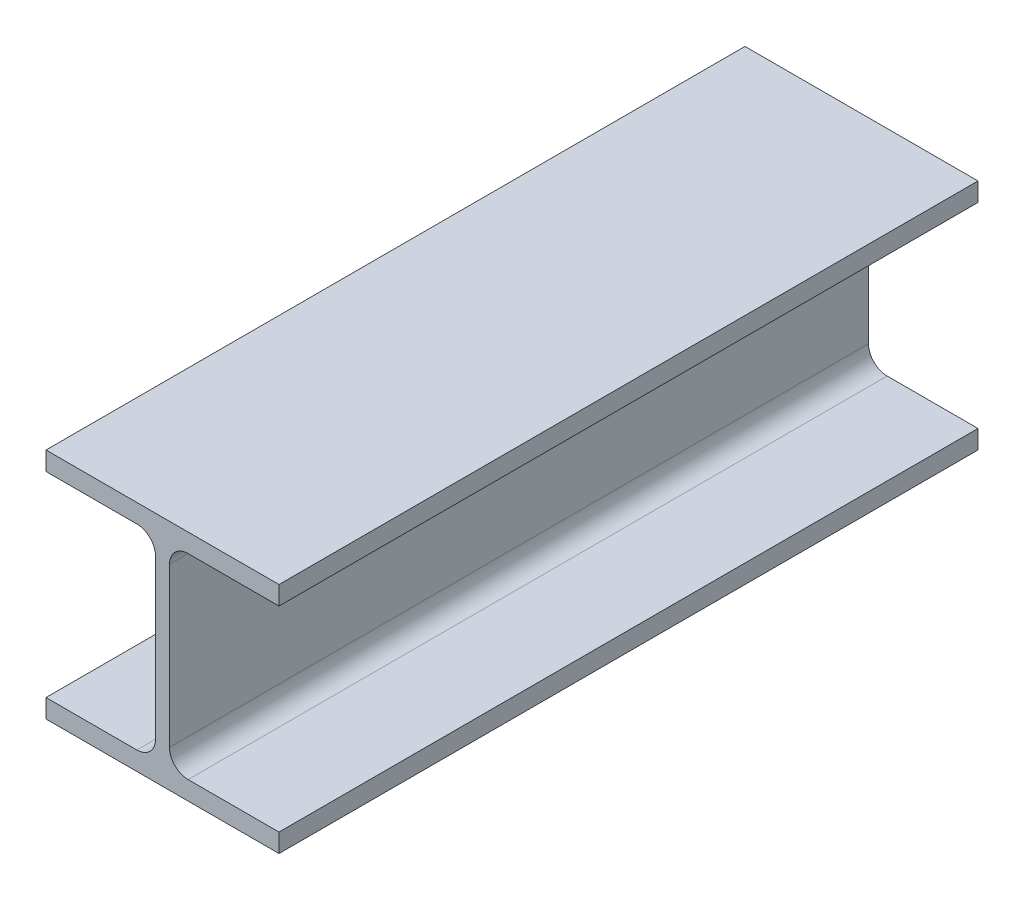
from build123d import *

# Parameters (mm, degrees)
EXTRUDE_1_DEPTH = 300


with BuildPart() as part:
    # Sketch 1 → Extrude 1 (new body)
    with BuildSketch(Plane.XY):
        with BuildLine():
            Line((50, -50), (-50, -50))
            Line((-50, -50), (-50, -42))
            Line((-50, -42), (-11, -42))
            ThreePointArc((-11, -42), (-5.343145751, -39.656854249), (-3, -34))
            Line((-3, -34), (-3, 34))
            ThreePointArc((-3, 34), (-5.343145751, 39.656854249), (-11, 42))
            Line((-11, 42), (-50, 42))
            Line((-50, 42), (-50, 50))
            Line((-50, 50), (50, 50))
            Line((50, 50), (50, 42))
            Line((50, 42), (11, 42))
            ThreePointArc((11, 42), (5.343145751, 39.656854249), (3, 34))
            Line((3, 34), (3, -34))
            ThreePointArc((3, -34), (5.343145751, -39.656854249), (11, -42))
            Line((11, -42), (50, -42))
            Line((50, -42), (50, -50))
        make_face()
    extrude(amount=EXTRUDE_1_DEPTH)


solid = part.part
